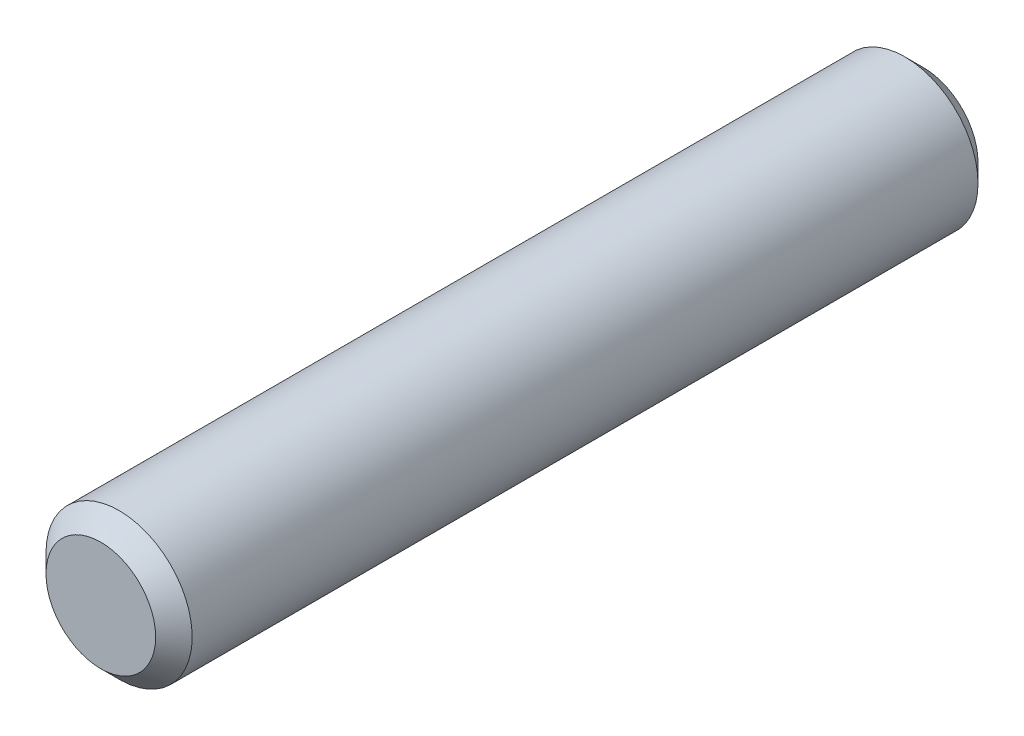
from build123d import *

# Parameters (mm, degrees)
ESQUISSE1_R        = 4
BOSS_EXTRU_1_DEPTH = 45
CHANFREIN1_SIZE    = 1


with BuildPart() as part:
    # Esquisse1 → Boss.-Extru.1 (new body)
    with BuildSketch(Plane.XY):
        with Locations(Location((0, 0, 0), (0, 0, 180))):
            Circle(ESQUISSE1_R)
    extrude(amount=BOSS_EXTRU_1_DEPTH)

    # Chanfrein1
    chanfrein1_edges = [part.edges().sort_by_distance(p)[0] for p in [
        (4, 0, 0),
        (4, 0, 45),
    ]]
    chamfer(chanfrein1_edges, length=CHANFREIN1_SIZE)


solid = part.part
